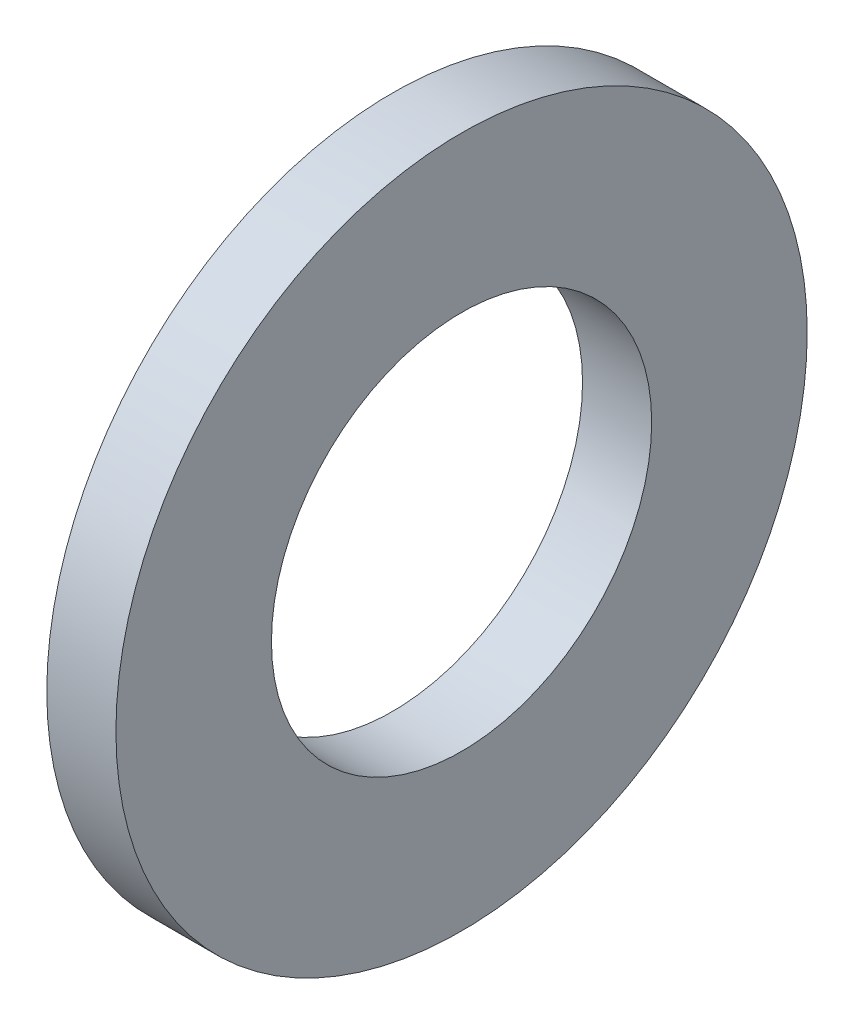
from build123d import *

# Parameters (mm, degrees)
SKETCH1_W = 2
SKETCH1_H = 4.5


with BuildPart() as part:
    # Sketch1 → Base-Revolve (revolve)
    with BuildSketch(Plane.XY, mode=Mode.PRIVATE) as base_revolve_sk:
        with Locations((-1, 7.75)):
            Rectangle(SKETCH1_W, SKETCH1_H)
    revolve(base_revolve_sk.sketch.rotate(Axis((-34.925, 0, 0), (1, 0, 0)), 90), axis=Axis((-34.925, 0, 0), (1, 0, 0)))


solid = part.part
